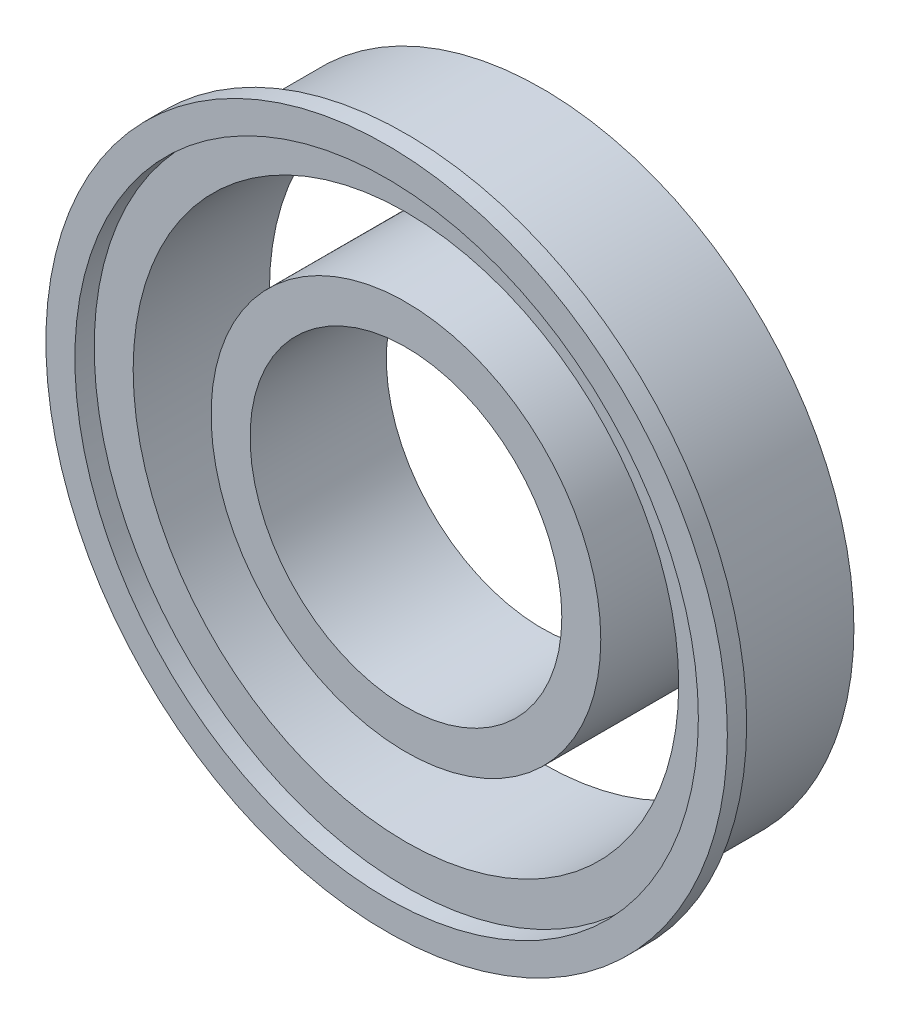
from build123d import *

# Parameters (mm, degrees)
SKETCH1_R        = 25.4
SKETCH1_R_2      = 22.225
EXTRUDE1_DEPTH   = 5.5499
SKETCH1_R_3      = 15.875
SKETCH1_R_4      = 12.7
EXTRUDE1_2_DEPTH = 5.5499
EXTRUDE3_START   = 1.5748
SKETCH4_R        = 27.761380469
SKETCH4_R_2      = 25.4
EXTRUDE3_DEPTH   = 1.5748


with BuildPart() as part:
    # Sketch1 → Extrude1 (new, symmetric)
    with BuildSketch(Plane.XY):
        Circle(SKETCH1_R)
        Circle(SKETCH1_R_2, mode=Mode.SUBTRACT)
    extrude(amount=EXTRUDE1_DEPTH, both=True)


with BuildPart() as body_2:
    # Sketch1 → Extrude1 2 (new, symmetric)
    with BuildSketch(Plane.XY):
        Circle(SKETCH1_R_3)
        Circle(SKETCH1_R_4, mode=Mode.SUBTRACT)
    extrude(amount=EXTRUDE1_2_DEPTH, both=True)


with BuildPart() as body_3:
    # Sketch4 → Extrude3 (new body)
    with BuildSketch(Plane.XY.offset(5.5499).offset(EXTRUDE3_START)):
        Circle(SKETCH4_R)
        Circle(SKETCH4_R_2, mode=Mode.SUBTRACT)
    extrude(amount=-EXTRUDE3_DEPTH)


solid = Compound([part.part, body_2.part, body_3.part])
